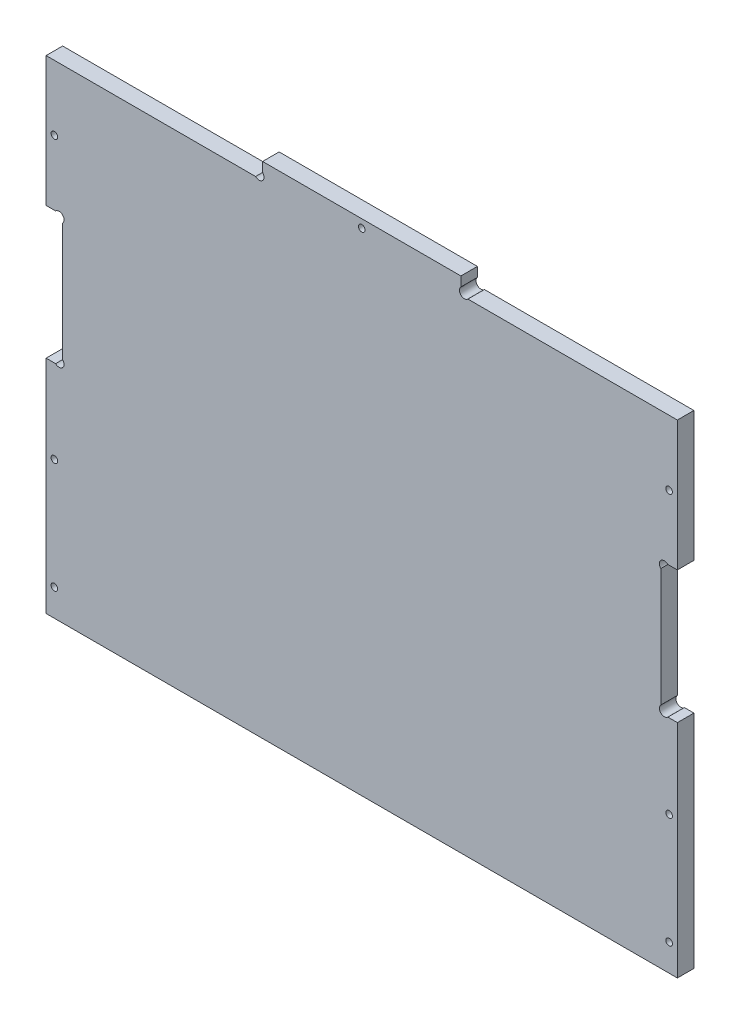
ISO-10303-21;
HEADER;
FILE_DESCRIPTION(('STEP AP214'),'2;1');
FILE_NAME('part.step','',(''),(''),'','','');
FILE_SCHEMA(('AUTOMOTIVE_DESIGN { 1 0 10303 214 1 1 1 1 }'));
ENDSEC;
DATA;
#1=APPLICATION_CONTEXT('core data for automotive mechanical design processes');
#2=APPLICATION_PROTOCOL_DEFINITION('international standard','automotive_design',2000,#1);
#3=PRODUCT_CONTEXT('',#1,'mechanical');
#4=PRODUCT('Part','Part','',(#3));
#5=PRODUCT_RELATED_PRODUCT_CATEGORY('part','',(#4));
#6=PRODUCT_DEFINITION_FORMATION('','',#4);
#7=PRODUCT_DEFINITION_CONTEXT('part definition',#1,'design');
#8=PRODUCT_DEFINITION('design','',#6,#7);
#9=PRODUCT_DEFINITION_SHAPE('','',#8);
#10=(LENGTH_UNIT() NAMED_UNIT(*) SI_UNIT(.MILLI.,.METRE.));
#11=(NAMED_UNIT(*) PLANE_ANGLE_UNIT() SI_UNIT($,.RADIAN.));
#12=(NAMED_UNIT(*) SI_UNIT($,.STERADIAN.) SOLID_ANGLE_UNIT());
#13=UNCERTAINTY_MEASURE_WITH_UNIT(LENGTH_MEASURE(1.E-05),#10,'distance_accuracy_value','');
#14=(GEOMETRIC_REPRESENTATION_CONTEXT(3) GLOBAL_UNCERTAINTY_ASSIGNED_CONTEXT((#13)) GLOBAL_UNIT_ASSIGNED_CONTEXT((#10,
#11,#12)) REPRESENTATION_CONTEXT('',''));
#15=CARTESIAN_POINT('',(0.,0.,0.));
#16=DIRECTION('',(0.,0.,1.));
#17=DIRECTION('',(1.,0.,0.));
#18=AXIS2_PLACEMENT_3D('',#15,#16,#17);
#19=CARTESIAN_POINT('',(30.,0.,5.));
#20=DIRECTION('',(1.,0.,0.));
#21=DIRECTION('',(0.,0.,-1.));
#22=AXIS2_PLACEMENT_3D('',#19,#20,#21);
#23=PLANE('',#22);
#24=DIRECTION('',(0.,-1.,0.));
#25=VECTOR('',#24,1.);
#26=CARTESIAN_POINT('',(30.,0.,0.));
#27=LINE('',#26,#25);
#28=CARTESIAN_POINT('',(30.,40.648672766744,0.));
#29=VERTEX_POINT('',#28);
#30=CARTESIAN_POINT('',(30.,37.7699931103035,0.));
#31=VERTEX_POINT('',#30);
#32=EDGE_CURVE('E232',#29,#31,#27,.T.);
#33=ORIENTED_EDGE('',*,*,#32,.F.);
#34=DIRECTION('',(0.,0.,-1.));
#35=VECTOR('',#34,1.);
#36=CARTESIAN_POINT('',(30.,40.648672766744,5.));
#37=LINE('',#36,#35);
#38=CARTESIAN_POINT('',(30.,40.648672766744,5.));
#39=VERTEX_POINT('',#38);
#40=EDGE_CURVE('E11',#39,#29,#37,.T.);
#41=ORIENTED_EDGE('',*,*,#40,.F.);
#42=DIRECTION('',(0.,-1.,0.));
#43=VECTOR('',#42,1.);
#44=CARTESIAN_POINT('',(30.,0.,5.));
#45=LINE('',#44,#43);
#46=CARTESIAN_POINT('',(30.,37.7699931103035,5.));
#47=VERTEX_POINT('',#46);
#48=EDGE_CURVE('E311',#39,#47,#45,.T.);
#49=ORIENTED_EDGE('',*,*,#48,.T.);
#50=DIRECTION('',(0.,0.,-1.));
#51=VECTOR('',#50,1.);
#52=CARTESIAN_POINT('',(30.,37.7699931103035,5.));
#53=LINE('',#52,#51);
#54=EDGE_CURVE('E126',#47,#31,#53,.T.);
#55=ORIENTED_EDGE('',*,*,#54,.T.);
#56=EDGE_LOOP('',(#33,#41,#49,#55));
#57=FACE_BOUND('',#56,.T.);
#58=ADVANCED_FACE('F34',(#57),#23,.T.);
#59=CARTESIAN_POINT('',(0.,40.648672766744,5.));
#60=DIRECTION('',(0.,1.,0.));
#61=DIRECTION('',(0.,0.,1.));
#62=AXIS2_PLACEMENT_3D('',#59,#60,#61);
#63=PLANE('',#62);
#64=DIRECTION('',(1.,0.,0.));
#65=VECTOR('',#64,1.);
#66=CARTESIAN_POINT('',(0.,40.648672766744,0.));
#67=LINE('',#66,#65);
#68=CARTESIAN_POINT('',(-30.,40.648672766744,0.));
#69=VERTEX_POINT('',#68);
#70=EDGE_CURVE('E235',#69,#29,#67,.T.);
#71=ORIENTED_EDGE('',*,*,#70,.F.);
#72=DIRECTION('',(0.,0.,-1.));
#73=VECTOR('',#72,1.);
#74=CARTESIAN_POINT('',(-30.,40.648672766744,5.));
#75=LINE('',#74,#73);
#76=CARTESIAN_POINT('',(-30.,40.648672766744,5.));
#77=VERTEX_POINT('',#76);
#78=EDGE_CURVE('E42',#77,#69,#75,.T.);
#79=ORIENTED_EDGE('',*,*,#78,.F.);
#80=DIRECTION('',(1.,0.,0.));
#81=VECTOR('',#80,1.);
#82=CARTESIAN_POINT('',(0.,40.648672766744,5.));
#83=LINE('',#82,#81);
#84=EDGE_CURVE('E366',#77,#39,#83,.T.);
#85=ORIENTED_EDGE('',*,*,#84,.T.);
#86=ORIENTED_EDGE('',*,*,#40,.T.);
#87=EDGE_LOOP('',(#71,#79,#85,#86));
#88=FACE_BOUND('',#87,.T.);
#89=ADVANCED_FACE('F365',(#88),#63,.T.);
#90=CARTESIAN_POINT('',(-30.,0.,5.));
#91=DIRECTION('',(1.,0.,0.));
#92=DIRECTION('',(0.,0.,-1.));
#93=AXIS2_PLACEMENT_3D('',#90,#91,#92);
#94=PLANE('',#93);
#95=DIRECTION('',(0.,-1.,0.));
#96=VECTOR('',#95,1.);
#97=CARTESIAN_POINT('',(-30.,0.,0.));
#98=LINE('',#97,#96);
#99=CARTESIAN_POINT('',(-30.,37.7699931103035,0.));
#100=VERTEX_POINT('',#99);
#101=EDGE_CURVE('E238',#69,#100,#98,.T.);
#102=ORIENTED_EDGE('',*,*,#101,.T.);
#103=DIRECTION('',(0.,0.,-1.));
#104=VECTOR('',#103,1.);
#105=CARTESIAN_POINT('',(-30.,37.7699931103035,5.));
#106=LINE('',#105,#104);
#107=CARTESIAN_POINT('',(-30.,37.7699931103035,5.));
#108=VERTEX_POINT('',#107);
#109=EDGE_CURVE('E349',#108,#100,#106,.T.);
#110=ORIENTED_EDGE('',*,*,#109,.F.);
#111=DIRECTION('',(0.,-1.,0.));
#112=VECTOR('',#111,1.);
#113=CARTESIAN_POINT('',(-30.,0.,5.));
#114=LINE('',#113,#112);
#115=EDGE_CURVE('E355',#77,#108,#114,.T.);
#116=ORIENTED_EDGE('',*,*,#115,.F.);
#117=ORIENTED_EDGE('',*,*,#78,.T.);
#118=EDGE_LOOP('',(#102,#110,#116,#117));
#119=FACE_BOUND('',#118,.T.);
#120=ADVANCED_FACE('F353',(#119),#94,.F.);
#121=CARTESIAN_POINT('',(-31.0606601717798,36.7093329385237,5.));
#122=DIRECTION('',(0.,0.,-1.));
#123=DIRECTION('',(-1.,0.,0.));
#124=AXIS2_PLACEMENT_3D('',#121,#122,#123);
#125=CYLINDRICAL_SURFACE('',#124,1.49999999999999);
#126=CARTESIAN_POINT('',(-31.0606601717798,36.7093329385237,0.));
#127=DIRECTION('',(0.,0.,1.));
#128=DIRECTION('',(1.,0.,0.));
#129=AXIS2_PLACEMENT_3D('',#126,#127,#128);
#130=CIRCLE('',#129,1.49999999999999);
#131=CARTESIAN_POINT('',(-32.1213203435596,35.6486727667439,0.));
#132=VERTEX_POINT('',#131);
#133=EDGE_CURVE('E241',#132,#100,#130,.T.);
#134=ORIENTED_EDGE('',*,*,#133,.F.);
#135=DIRECTION('',(0.,0.,-1.));
#136=VECTOR('',#135,1.);
#137=CARTESIAN_POINT('',(-32.1213203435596,35.6486727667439,5.));
#138=LINE('',#137,#136);
#139=CARTESIAN_POINT('',(-32.1213203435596,35.6486727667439,5.));
#140=VERTEX_POINT('',#139);
#141=EDGE_CURVE('E347',#140,#132,#138,.T.);
#142=ORIENTED_EDGE('',*,*,#141,.F.);
#143=CARTESIAN_POINT('',(-31.0606601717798,36.7093329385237,5.));
#144=DIRECTION('',(0.,0.,1.));
#145=DIRECTION('',(1.,0.,0.));
#146=AXIS2_PLACEMENT_3D('',#143,#144,#145);
#147=CIRCLE('',#146,1.49999999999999);
#148=EDGE_CURVE('E372',#140,#108,#147,.T.);
#149=ORIENTED_EDGE('',*,*,#148,.T.);
#150=ORIENTED_EDGE('',*,*,#109,.T.);
#151=EDGE_LOOP('',(#134,#142,#149,#150));
#152=FACE_BOUND('',#151,.T.);
#153=ADVANCED_FACE('F475',(#152),#125,.F.);
#154=CARTESIAN_POINT('',(0.,35.6486727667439,5.));
#155=DIRECTION('',(0.,-1.,0.));
#156=DIRECTION('',(1.,0.,0.));
#157=AXIS2_PLACEMENT_3D('',#154,#155,#156);
#158=PLANE('',#157);
#159=DIRECTION('',(-1.,0.,0.));
#160=VECTOR('',#159,1.);
#161=CARTESIAN_POINT('',(0.,35.6486727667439,0.));
#162=LINE('',#161,#160);
#163=CARTESIAN_POINT('',(-95.5,35.6486727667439,0.));
#164=VERTEX_POINT('',#163);
#165=EDGE_CURVE('E244',#132,#164,#162,.T.);
#166=ORIENTED_EDGE('',*,*,#165,.T.);
#167=DIRECTION('',(0.,0.,-1.));
#168=VECTOR('',#167,1.);
#169=CARTESIAN_POINT('',(-95.5,35.6486727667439,5.));
#170=LINE('',#169,#168);
#171=CARTESIAN_POINT('',(-95.5,35.6486727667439,5.));
#172=VERTEX_POINT('',#171);
#173=EDGE_CURVE('E344',#172,#164,#170,.T.);
#174=ORIENTED_EDGE('',*,*,#173,.F.);
#175=DIRECTION('',(-1.,0.,0.));
#176=VECTOR('',#175,1.);
#177=CARTESIAN_POINT('',(0.,35.6486727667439,5.));
#178=LINE('',#177,#176);
#179=EDGE_CURVE('E375',#140,#172,#178,.T.);
#180=ORIENTED_EDGE('',*,*,#179,.F.);
#181=ORIENTED_EDGE('',*,*,#141,.T.);
#182=EDGE_LOOP('',(#166,#174,#180,#181));
#183=FACE_BOUND('',#182,.T.);
#184=ADVANCED_FACE('F472',(#183),#158,.F.);
#185=CARTESIAN_POINT('',(-95.5,0.,5.));
#186=DIRECTION('',(1.,0.,0.));
#187=DIRECTION('',(0.,0.,-1.));
#188=AXIS2_PLACEMENT_3D('',#185,#186,#187);
#189=PLANE('',#188);
#190=DIRECTION('',(0.,-1.,0.));
#191=VECTOR('',#190,1.);
#192=CARTESIAN_POINT('',(-95.5,0.,0.));
#193=LINE('',#192,#191);
#194=CARTESIAN_POINT('',(-95.5,-3.64132723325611,0.));
#195=VERTEX_POINT('',#194);
#196=EDGE_CURVE('E246',#164,#195,#193,.T.);
#197=ORIENTED_EDGE('',*,*,#196,.T.);
#198=DIRECTION('',(0.,0.,-1.));
#199=VECTOR('',#198,1.);
#200=CARTESIAN_POINT('',(-95.5,-3.64132723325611,5.));
#201=LINE('',#200,#199);
#202=CARTESIAN_POINT('',(-95.5,-3.64132723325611,5.));
#203=VERTEX_POINT('',#202);
#204=EDGE_CURVE('E341',#203,#195,#201,.T.);
#205=ORIENTED_EDGE('',*,*,#204,.F.);
#206=DIRECTION('',(0.,-1.,0.));
#207=VECTOR('',#206,1.);
#208=CARTESIAN_POINT('',(-95.5,0.,5.));
#209=LINE('',#208,#207);
#210=EDGE_CURVE('E377',#172,#203,#209,.T.);
#211=ORIENTED_EDGE('',*,*,#210,.F.);
#212=ORIENTED_EDGE('',*,*,#173,.T.);
#213=EDGE_LOOP('',(#197,#205,#211,#212));
#214=FACE_BOUND('',#213,.T.);
#215=ADVANCED_FACE('F467',(#214),#189,.F.);
#216=CARTESIAN_POINT('',(0.,-3.64132723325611,5.));
#217=DIRECTION('',(0.,1.,0.));
#218=DIRECTION('',(0.,0.,1.));
#219=AXIS2_PLACEMENT_3D('',#216,#217,#218);
#220=PLANE('',#219);
#221=DIRECTION('',(1.,0.,0.));
#222=VECTOR('',#221,1.);
#223=CARTESIAN_POINT('',(0.,-3.64132723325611,0.));
#224=LINE('',#223,#222);
#225=CARTESIAN_POINT('',(-92.6213203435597,-3.64132723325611,0.));
#226=VERTEX_POINT('',#225);
#227=EDGE_CURVE('E248',#195,#226,#224,.T.);
#228=ORIENTED_EDGE('',*,*,#227,.T.);
#229=DIRECTION('',(0.,0.,-1.));
#230=VECTOR('',#229,1.);
#231=CARTESIAN_POINT('',(-92.6213203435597,-3.64132723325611,5.));
#232=LINE('',#231,#230);
#233=CARTESIAN_POINT('',(-92.6213203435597,-3.64132723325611,5.));
#234=VERTEX_POINT('',#233);
#235=EDGE_CURVE('E339',#234,#226,#232,.T.);
#236=ORIENTED_EDGE('',*,*,#235,.F.);
#237=DIRECTION('',(1.,0.,0.));
#238=VECTOR('',#237,1.);
#239=CARTESIAN_POINT('',(0.,-3.64132723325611,5.));
#240=LINE('',#239,#238);
#241=EDGE_CURVE('E379',#203,#234,#240,.T.);
#242=ORIENTED_EDGE('',*,*,#241,.F.);
#243=ORIENTED_EDGE('',*,*,#204,.T.);
#244=EDGE_LOOP('',(#228,#236,#242,#243));
#245=FACE_BOUND('',#244,.T.);
#246=ADVANCED_FACE('F463',(#245),#220,.F.);
#247=CARTESIAN_POINT('',(-91.5606601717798,-4.70198740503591,5.));
#248=DIRECTION('',(0.,0.,-1.));
#249=DIRECTION('',(-1.,0.,0.));
#250=AXIS2_PLACEMENT_3D('',#247,#248,#249);
#251=CYLINDRICAL_SURFACE('',#250,1.50000000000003);
#252=CARTESIAN_POINT('',(-91.5606601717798,-4.70198740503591,0.));
#253=DIRECTION('',(0.,0.,1.));
#254=DIRECTION('',(1.,0.,0.));
#255=AXIS2_PLACEMENT_3D('',#252,#253,#254);
#256=CIRCLE('',#255,1.50000000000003);
#257=CARTESIAN_POINT('',(-90.5000000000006,-5.76264757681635,0.));
#258=VERTEX_POINT('',#257);
#259=EDGE_CURVE('E251',#258,#226,#256,.T.);
#260=ORIENTED_EDGE('',*,*,#259,.F.);
#261=DIRECTION('',(0.,0.,-1.));
#262=VECTOR('',#261,1.);
#263=CARTESIAN_POINT('',(-90.5000000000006,-5.76264757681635,5.));
#264=LINE('',#263,#262);
#265=CARTESIAN_POINT('',(-90.5000000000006,-5.76264757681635,5.));
#266=VERTEX_POINT('',#265);
#267=EDGE_CURVE('E337',#266,#258,#264,.T.);
#268=ORIENTED_EDGE('',*,*,#267,.F.);
#269=CARTESIAN_POINT('',(-91.5606601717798,-4.70198740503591,5.));
#270=DIRECTION('',(0.,0.,1.));
#271=DIRECTION('',(1.,0.,0.));
#272=AXIS2_PLACEMENT_3D('',#269,#270,#271);
#273=CIRCLE('',#272,1.50000000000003);
#274=EDGE_CURVE('E381',#266,#234,#273,.T.);
#275=ORIENTED_EDGE('',*,*,#274,.T.);
#276=ORIENTED_EDGE('',*,*,#235,.T.);
#277=EDGE_LOOP('',(#260,#268,#275,#276));
#278=FACE_BOUND('',#277,.T.);
#279=ADVANCED_FACE('F458',(#278),#251,.F.);
#280=CARTESIAN_POINT('',(-90.5000000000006,0.,5.));
#281=DIRECTION('',(1.,0.,0.));
#282=DIRECTION('',(0.,1.,0.));
#283=AXIS2_PLACEMENT_3D('',#280,#281,#282);
#284=PLANE('',#283);
#285=DIRECTION('',(0.,-1.,0.));
#286=VECTOR('',#285,1.);
#287=CARTESIAN_POINT('',(-90.5000000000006,0.,0.));
#288=LINE('',#287,#286);
#289=CARTESIAN_POINT('',(-90.5000000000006,-41.5200068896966,0.));
#290=VERTEX_POINT('',#289);
#291=EDGE_CURVE('E254',#258,#290,#288,.T.);
#292=ORIENTED_EDGE('',*,*,#291,.T.);
#293=DIRECTION('',(0.,0.,-1.));
#294=VECTOR('',#293,1.);
#295=CARTESIAN_POINT('',(-90.5000000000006,-41.5200068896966,5.));
#296=LINE('',#295,#294);
#297=CARTESIAN_POINT('',(-90.5000000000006,-41.5200068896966,5.));
#298=VERTEX_POINT('',#297);
#299=EDGE_CURVE('E335',#298,#290,#296,.T.);
#300=ORIENTED_EDGE('',*,*,#299,.F.);
#301=DIRECTION('',(0.,-1.,0.));
#302=VECTOR('',#301,1.);
#303=CARTESIAN_POINT('',(-90.5000000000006,0.,5.));
#304=LINE('',#303,#302);
#305=EDGE_CURVE('E384',#266,#298,#304,.T.);
#306=ORIENTED_EDGE('',*,*,#305,.F.);
#307=ORIENTED_EDGE('',*,*,#267,.T.);
#308=EDGE_LOOP('',(#292,#300,#306,#307));
#309=FACE_BOUND('',#308,.T.);
#310=ADVANCED_FACE('F454',(#309),#284,.F.);
#311=CARTESIAN_POINT('',(-91.5606601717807,-42.5806670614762,5.));
#312=DIRECTION('',(0.,0.,-1.));
#313=DIRECTION('',(-1.,0.,0.));
#314=AXIS2_PLACEMENT_3D('',#311,#312,#313);
#315=CYLINDRICAL_SURFACE('',#314,1.50000000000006);
#316=CARTESIAN_POINT('',(-91.5606601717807,-42.5806670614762,0.));
#317=DIRECTION('',(0.,0.,1.));
#318=DIRECTION('',(1.,0.,0.));
#319=AXIS2_PLACEMENT_3D('',#316,#317,#318);
#320=CIRCLE('',#319,1.50000000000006);
#321=CARTESIAN_POINT('',(-92.6213203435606,-43.6413272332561,0.));
#322=VERTEX_POINT('',#321);
#323=EDGE_CURVE('E257',#322,#290,#320,.T.);
#324=ORIENTED_EDGE('',*,*,#323,.F.);
#325=DIRECTION('',(0.,0.,-1.));
#326=VECTOR('',#325,1.);
#327=CARTESIAN_POINT('',(-92.6213203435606,-43.6413272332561,5.));
#328=LINE('',#327,#326);
#329=CARTESIAN_POINT('',(-92.6213203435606,-43.6413272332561,5.));
#330=VERTEX_POINT('',#329);
#331=EDGE_CURVE('E333',#330,#322,#328,.T.);
#332=ORIENTED_EDGE('',*,*,#331,.F.);
#333=CARTESIAN_POINT('',(-91.5606601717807,-42.5806670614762,5.));
#334=DIRECTION('',(0.,0.,1.));
#335=DIRECTION('',(1.,0.,0.));
#336=AXIS2_PLACEMENT_3D('',#333,#334,#335);
#337=CIRCLE('',#336,1.50000000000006);
#338=EDGE_CURVE('E386',#330,#298,#337,.T.);
#339=ORIENTED_EDGE('',*,*,#338,.T.);
#340=ORIENTED_EDGE('',*,*,#299,.T.);
#341=EDGE_LOOP('',(#324,#332,#339,#340));
#342=FACE_BOUND('',#341,.T.);
#343=ADVANCED_FACE('F450',(#342),#315,.F.);
#344=CARTESIAN_POINT('',(-3.15584826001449E-13,-43.6413272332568,5.));
#345=DIRECTION('',(0.,-1.,0.));
#346=DIRECTION('',(1.,0.,0.));
#347=AXIS2_PLACEMENT_3D('',#344,#345,#346);
#348=PLANE('',#347);
#349=DIRECTION('',(-1.,0.,0.));
#350=VECTOR('',#349,1.);
#351=CARTESIAN_POINT('',(-3.15584826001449E-13,-43.6413272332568,0.));
#352=LINE('',#351,#350);
#353=CARTESIAN_POINT('',(-95.5000000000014,-43.6413272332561,0.));
#354=VERTEX_POINT('',#353);
#355=EDGE_CURVE('E260',#322,#354,#352,.T.);
#356=ORIENTED_EDGE('',*,*,#355,.T.);
#357=DIRECTION('',(0.,0.,-1.));
#358=VECTOR('',#357,1.);
#359=CARTESIAN_POINT('',(-95.5000000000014,-43.6413272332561,5.));
#360=LINE('',#359,#358);
#361=CARTESIAN_POINT('',(-95.5000000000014,-43.6413272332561,5.));
#362=VERTEX_POINT('',#361);
#363=EDGE_CURVE('E330',#362,#354,#360,.T.);
#364=ORIENTED_EDGE('',*,*,#363,.F.);
#365=DIRECTION('',(-1.,0.,0.));
#366=VECTOR('',#365,1.);
#367=CARTESIAN_POINT('',(-3.15584826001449E-13,-43.6413272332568,5.));
#368=LINE('',#367,#366);
#369=EDGE_CURVE('E389',#330,#362,#368,.T.);
#370=ORIENTED_EDGE('',*,*,#369,.F.);
#371=ORIENTED_EDGE('',*,*,#331,.T.);
#372=EDGE_LOOP('',(#356,#364,#370,#371));
#373=FACE_BOUND('',#372,.T.);
#374=ADVANCED_FACE('F445',(#373),#348,.F.);
#375=CARTESIAN_POINT('',(-95.5000000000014,0.,5.));
#376=DIRECTION('',(1.,0.,0.));
#377=DIRECTION('',(0.,1.,0.));
#378=AXIS2_PLACEMENT_3D('',#375,#376,#377);
#379=PLANE('',#378);
#380=DIRECTION('',(0.,-1.,0.));
#381=VECTOR('',#380,1.);
#382=CARTESIAN_POINT('',(-95.5000000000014,0.,0.));
#383=LINE('',#382,#381);
#384=CARTESIAN_POINT('',(-95.5000000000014,-110.561327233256,0.));
#385=VERTEX_POINT('',#384);
#386=EDGE_CURVE('E262',#354,#385,#383,.T.);
#387=ORIENTED_EDGE('',*,*,#386,.T.);
#388=DIRECTION('',(0.,0.,-1.));
#389=VECTOR('',#388,1.);
#390=CARTESIAN_POINT('',(-95.5000000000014,-110.561327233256,5.));
#391=LINE('',#390,#389);
#392=CARTESIAN_POINT('',(-95.5000000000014,-110.561327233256,5.));
#393=VERTEX_POINT('',#392);
#394=EDGE_CURVE('E327',#393,#385,#391,.T.);
#395=ORIENTED_EDGE('',*,*,#394,.F.);
#396=DIRECTION('',(0.,-1.,0.));
#397=VECTOR('',#396,1.);
#398=CARTESIAN_POINT('',(-95.5000000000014,0.,5.));
#399=LINE('',#398,#397);
#400=EDGE_CURVE('E391',#362,#393,#399,.T.);
#401=ORIENTED_EDGE('',*,*,#400,.F.);
#402=ORIENTED_EDGE('',*,*,#363,.T.);
#403=EDGE_LOOP('',(#387,#395,#401,#402));
#404=FACE_BOUND('',#403,.T.);
#405=ADVANCED_FACE('F441',(#404),#379,.F.);
#406=CARTESIAN_POINT('',(0.,-110.561327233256,5.));
#407=DIRECTION('',(0.,1.,0.));
#408=DIRECTION('',(0.,0.,1.));
#409=AXIS2_PLACEMENT_3D('',#406,#407,#408);
#410=PLANE('',#409);
#411=DIRECTION('',(1.,0.,0.));
#412=VECTOR('',#411,1.);
#413=CARTESIAN_POINT('',(0.,-110.561327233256,0.));
#414=LINE('',#413,#412);
#415=CARTESIAN_POINT('',(95.5000000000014,-110.561327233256,0.));
#416=VERTEX_POINT('',#415);
#417=EDGE_CURVE('E264',#385,#416,#414,.T.);
#418=ORIENTED_EDGE('',*,*,#417,.T.);
#419=DIRECTION('',(0.,0.,-1.));
#420=VECTOR('',#419,1.);
#421=CARTESIAN_POINT('',(95.5000000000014,-110.561327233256,5.));
#422=LINE('',#421,#420);
#423=CARTESIAN_POINT('',(95.5000000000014,-110.561327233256,5.));
#424=VERTEX_POINT('',#423);
#425=EDGE_CURVE('E325',#424,#416,#422,.T.);
#426=ORIENTED_EDGE('',*,*,#425,.F.);
#427=DIRECTION('',(1.,0.,0.));
#428=VECTOR('',#427,1.);
#429=CARTESIAN_POINT('',(0.,-110.561327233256,5.));
#430=LINE('',#429,#428);
#431=EDGE_CURVE('E393',#393,#424,#430,.T.);
#432=ORIENTED_EDGE('',*,*,#431,.F.);
#433=ORIENTED_EDGE('',*,*,#394,.T.);
#434=EDGE_LOOP('',(#418,#426,#432,#433));
#435=FACE_BOUND('',#434,.T.);
#436=ADVANCED_FACE('F436',(#435),#410,.F.);
#437=CARTESIAN_POINT('',(95.5000000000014,0.,5.));
#438=DIRECTION('',(1.,0.,0.));
#439=DIRECTION('',(0.,1.,0.));
#440=AXIS2_PLACEMENT_3D('',#437,#438,#439);
#441=PLANE('',#440);
#442=DIRECTION('',(0.,-1.,0.));
#443=VECTOR('',#442,1.);
#444=CARTESIAN_POINT('',(95.5000000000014,0.,0.));
#445=LINE('',#444,#443);
#446=CARTESIAN_POINT('',(95.5000000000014,-43.6413272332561,0.));
#447=VERTEX_POINT('',#446);
#448=EDGE_CURVE('E267',#447,#416,#445,.T.);
#449=ORIENTED_EDGE('',*,*,#448,.F.);
#450=DIRECTION('',(0.,0.,-1.));
#451=VECTOR('',#450,1.);
#452=CARTESIAN_POINT('',(95.5000000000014,-43.6413272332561,5.));
#453=LINE('',#452,#451);
#454=CARTESIAN_POINT('',(95.5000000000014,-43.6413272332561,5.));
#455=VERTEX_POINT('',#454);
#456=EDGE_CURVE('E323',#455,#447,#453,.T.);
#457=ORIENTED_EDGE('',*,*,#456,.F.);
#458=DIRECTION('',(0.,-1.,0.));
#459=VECTOR('',#458,1.);
#460=CARTESIAN_POINT('',(95.5000000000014,0.,5.));
#461=LINE('',#460,#459);
#462=EDGE_CURVE('E395',#455,#424,#461,.T.);
#463=ORIENTED_EDGE('',*,*,#462,.T.);
#464=ORIENTED_EDGE('',*,*,#425,.T.);
#465=EDGE_LOOP('',(#449,#457,#463,#464));
#466=FACE_BOUND('',#465,.T.);
#467=ADVANCED_FACE('F430',(#466),#441,.T.);
#468=CARTESIAN_POINT('',(0.,-43.6413272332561,5.));
#469=DIRECTION('',(0.,1.,0.));
#470=DIRECTION('',(0.,0.,1.));
#471=AXIS2_PLACEMENT_3D('',#468,#469,#470);
#472=PLANE('',#471);
#473=DIRECTION('',(1.,0.,0.));
#474=VECTOR('',#473,1.);
#475=CARTESIAN_POINT('',(0.,-43.6413272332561,0.));
#476=LINE('',#475,#474);
#477=CARTESIAN_POINT('',(92.6213203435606,-43.6413272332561,0.));
#478=VERTEX_POINT('',#477);
#479=EDGE_CURVE('E270',#478,#447,#476,.T.);
#480=ORIENTED_EDGE('',*,*,#479,.F.);
#481=DIRECTION('',(0.,0.,-1.));
#482=VECTOR('',#481,1.);
#483=CARTESIAN_POINT('',(92.6213203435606,-43.6413272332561,5.));
#484=LINE('',#483,#482);
#485=CARTESIAN_POINT('',(92.6213203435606,-43.6413272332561,5.));
#486=VERTEX_POINT('',#485);
#487=EDGE_CURVE('E321',#486,#478,#484,.T.);
#488=ORIENTED_EDGE('',*,*,#487,.F.);
#489=DIRECTION('',(1.,0.,0.));
#490=VECTOR('',#489,1.);
#491=CARTESIAN_POINT('',(0.,-43.6413272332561,5.));
#492=LINE('',#491,#490);
#493=EDGE_CURVE('E398',#486,#455,#492,.T.);
#494=ORIENTED_EDGE('',*,*,#493,.T.);
#495=ORIENTED_EDGE('',*,*,#456,.T.);
#496=EDGE_LOOP('',(#480,#488,#494,#495));
#497=FACE_BOUND('',#496,.T.);
#498=ADVANCED_FACE('F425',(#497),#472,.T.);
#499=CARTESIAN_POINT('',(91.5606601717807,-42.5806670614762,5.));
#500=DIRECTION('',(0.,0.,-1.));
#501=DIRECTION('',(-1.,0.,0.));
#502=AXIS2_PLACEMENT_3D('',#499,#500,#501);
#503=CYLINDRICAL_SURFACE('',#502,1.50000000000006);
#504=CARTESIAN_POINT('',(91.5606601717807,-42.5806670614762,0.));
#505=DIRECTION('',(0.,0.,1.));
#506=DIRECTION('',(1.,0.,0.));
#507=AXIS2_PLACEMENT_3D('',#504,#505,#506);
#508=CIRCLE('',#507,1.50000000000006);
#509=CARTESIAN_POINT('',(90.5000000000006,-41.5200068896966,0.));
#510=VERTEX_POINT('',#509);
#511=EDGE_CURVE('E273',#478,#510,#508,.F.);
#512=ORIENTED_EDGE('',*,*,#511,.T.);
#513=DIRECTION('',(0.,0.,-1.));
#514=VECTOR('',#513,1.);
#515=CARTESIAN_POINT('',(90.5000000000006,-41.5200068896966,5.));
#516=LINE('',#515,#514);
#517=CARTESIAN_POINT('',(90.5000000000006,-41.5200068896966,5.));
#518=VERTEX_POINT('',#517);
#519=EDGE_CURVE('E319',#518,#510,#516,.T.);
#520=ORIENTED_EDGE('',*,*,#519,.F.);
#521=CARTESIAN_POINT('',(91.5606601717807,-42.5806670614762,5.));
#522=DIRECTION('',(0.,0.,1.));
#523=DIRECTION('',(1.,0.,0.));
#524=AXIS2_PLACEMENT_3D('',#521,#522,#523);
#525=CIRCLE('',#524,1.50000000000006);
#526=EDGE_CURVE('E401',#486,#518,#525,.F.);
#527=ORIENTED_EDGE('',*,*,#526,.F.);
#528=ORIENTED_EDGE('',*,*,#487,.T.);
#529=EDGE_LOOP('',(#512,#520,#527,#528));
#530=FACE_BOUND('',#529,.T.);
#531=ADVANCED_FACE('F422',(#530),#503,.F.);
#532=CARTESIAN_POINT('',(90.5000000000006,0.,5.));
#533=DIRECTION('',(1.,0.,0.));
#534=DIRECTION('',(0.,0.,-1.));
#535=AXIS2_PLACEMENT_3D('',#532,#533,#534);
#536=PLANE('',#535);
#537=DIRECTION('',(0.,-1.,0.));
#538=VECTOR('',#537,1.);
#539=CARTESIAN_POINT('',(90.5000000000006,0.,0.));
#540=LINE('',#539,#538);
#541=CARTESIAN_POINT('',(90.5000000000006,-5.76264757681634,0.));
#542=VERTEX_POINT('',#541);
#543=EDGE_CURVE('E276',#542,#510,#540,.T.);
#544=ORIENTED_EDGE('',*,*,#543,.F.);
#545=DIRECTION('',(0.,0.,-1.));
#546=VECTOR('',#545,1.);
#547=CARTESIAN_POINT('',(90.5000000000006,-5.76264757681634,5.));
#548=LINE('',#547,#546);
#549=CARTESIAN_POINT('',(90.5000000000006,-5.76264757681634,5.));
#550=VERTEX_POINT('',#549);
#551=EDGE_CURVE('E317',#550,#542,#548,.T.);
#552=ORIENTED_EDGE('',*,*,#551,.F.);
#553=DIRECTION('',(0.,-1.,0.));
#554=VECTOR('',#553,1.);
#555=CARTESIAN_POINT('',(90.5000000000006,0.,5.));
#556=LINE('',#555,#554);
#557=EDGE_CURVE('E403',#550,#518,#556,.T.);
#558=ORIENTED_EDGE('',*,*,#557,.T.);
#559=ORIENTED_EDGE('',*,*,#519,.T.);
#560=EDGE_LOOP('',(#544,#552,#558,#559));
#561=FACE_BOUND('',#560,.T.);
#562=ADVANCED_FACE('F416',(#561),#536,.T.);
#563=CARTESIAN_POINT('',(91.5606601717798,-4.70198740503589,5.));
#564=DIRECTION('',(0.,0.,-1.));
#565=DIRECTION('',(-1.,0.,0.));
#566=AXIS2_PLACEMENT_3D('',#563,#564,#565);
#567=CYLINDRICAL_SURFACE('',#566,1.50000000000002);
#568=CARTESIAN_POINT('',(91.5606601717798,-4.70198740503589,0.));
#569=DIRECTION('',(0.,0.,1.));
#570=DIRECTION('',(1.,0.,0.));
#571=AXIS2_PLACEMENT_3D('',#568,#569,#570);
#572=CIRCLE('',#571,1.50000000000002);
#573=CARTESIAN_POINT('',(92.6213203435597,-3.64132723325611,0.));
#574=VERTEX_POINT('',#573);
#575=EDGE_CURVE('E279',#542,#574,#572,.F.);
#576=ORIENTED_EDGE('',*,*,#575,.T.);
#577=DIRECTION('',(0.,0.,-1.));
#578=VECTOR('',#577,1.);
#579=CARTESIAN_POINT('',(92.6213203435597,-3.64132723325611,5.));
#580=LINE('',#579,#578);
#581=CARTESIAN_POINT('',(92.6213203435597,-3.64132723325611,5.));
#582=VERTEX_POINT('',#581);
#583=EDGE_CURVE('E315',#582,#574,#580,.T.);
#584=ORIENTED_EDGE('',*,*,#583,.F.);
#585=CARTESIAN_POINT('',(91.5606601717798,-4.70198740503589,5.));
#586=DIRECTION('',(0.,0.,1.));
#587=DIRECTION('',(1.,0.,0.));
#588=AXIS2_PLACEMENT_3D('',#585,#586,#587);
#589=CIRCLE('',#588,1.50000000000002);
#590=EDGE_CURVE('E406',#550,#582,#589,.F.);
#591=ORIENTED_EDGE('',*,*,#590,.F.);
#592=ORIENTED_EDGE('',*,*,#551,.T.);
#593=EDGE_LOOP('',(#576,#584,#591,#592));
#594=FACE_BOUND('',#593,.T.);
#595=ADVANCED_FACE('F476',(#594),#567,.F.);
#596=CARTESIAN_POINT('',(0.,-3.64132723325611,5.));
#597=DIRECTION('',(0.,-1.,0.));
#598=DIRECTION('',(0.,0.,-1.));
#599=AXIS2_PLACEMENT_3D('',#596,#597,#598);
#600=PLANE('',#599);
#601=DIRECTION('',(-1.,0.,0.));
#602=VECTOR('',#601,1.);
#603=CARTESIAN_POINT('',(0.,-3.64132723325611,0.));
#604=LINE('',#603,#602);
#605=CARTESIAN_POINT('',(95.5,-3.64132723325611,0.));
#606=VERTEX_POINT('',#605);
#607=EDGE_CURVE('E282',#606,#574,#604,.T.);
#608=ORIENTED_EDGE('',*,*,#607,.F.);
#609=DIRECTION('',(0.,0.,-1.));
#610=VECTOR('',#609,1.);
#611=CARTESIAN_POINT('',(95.5,-3.64132723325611,5.));
#612=LINE('',#611,#610);
#613=CARTESIAN_POINT('',(95.5,-3.64132723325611,5.));
#614=VERTEX_POINT('',#613);
#615=EDGE_CURVE('E197',#614,#606,#612,.T.);
#616=ORIENTED_EDGE('',*,*,#615,.F.);
#617=DIRECTION('',(-1.,0.,0.));
#618=VECTOR('',#617,1.);
#619=CARTESIAN_POINT('',(0.,-3.64132723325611,5.));
#620=LINE('',#619,#618);
#621=EDGE_CURVE('E204',#614,#582,#620,.T.);
#622=ORIENTED_EDGE('',*,*,#621,.T.);
#623=ORIENTED_EDGE('',*,*,#583,.T.);
#624=EDGE_LOOP('',(#608,#616,#622,#623));
#625=FACE_BOUND('',#624,.T.);
#626=ADVANCED_FACE('F409',(#625),#600,.T.);
#627=CARTESIAN_POINT('',(95.5,0.,5.));
#628=DIRECTION('',(1.,0.,0.));
#629=DIRECTION('',(0.,0.,-1.));
#630=AXIS2_PLACEMENT_3D('',#627,#628,#629);
#631=PLANE('',#630);
#632=DIRECTION('',(0.,-1.,0.));
#633=VECTOR('',#632,1.);
#634=CARTESIAN_POINT('',(95.5,0.,0.));
#635=LINE('',#634,#633);
#636=CARTESIAN_POINT('',(95.5,35.6486727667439,0.));
#637=VERTEX_POINT('',#636);
#638=EDGE_CURVE('E192',#637,#606,#635,.T.);
#639=ORIENTED_EDGE('',*,*,#638,.F.);
#640=DIRECTION('',(0.,0.,-1.));
#641=VECTOR('',#640,1.);
#642=CARTESIAN_POINT('',(95.5,35.6486727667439,5.));
#643=LINE('',#642,#641);
#644=CARTESIAN_POINT('',(95.5,35.6486727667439,5.));
#645=VERTEX_POINT('',#644);
#646=EDGE_CURVE('E187',#645,#637,#643,.T.);
#647=ORIENTED_EDGE('',*,*,#646,.F.);
#648=DIRECTION('',(0.,-1.,0.));
#649=VECTOR('',#648,1.);
#650=CARTESIAN_POINT('',(95.5,0.,5.));
#651=LINE('',#650,#649);
#652=EDGE_CURVE('E190',#645,#614,#651,.T.);
#653=ORIENTED_EDGE('',*,*,#652,.T.);
#654=ORIENTED_EDGE('',*,*,#615,.T.);
#655=EDGE_LOOP('',(#639,#647,#653,#654));
#656=FACE_BOUND('',#655,.T.);
#657=ADVANCED_FACE('F189',(#656),#631,.T.);
#658=CARTESIAN_POINT('',(0.,35.6486727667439,5.));
#659=DIRECTION('',(0.,1.,0.));
#660=DIRECTION('',(-1.,0.,0.));
#661=AXIS2_PLACEMENT_3D('',#658,#659,#660);
#662=PLANE('',#661);
#663=DIRECTION('',(1.,0.,0.));
#664=VECTOR('',#663,1.);
#665=CARTESIAN_POINT('',(0.,35.6486727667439,0.));
#666=LINE('',#665,#664);
#667=CARTESIAN_POINT('',(32.1213203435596,35.6486727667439,0.));
#668=VERTEX_POINT('',#667);
#669=EDGE_CURVE('E286',#668,#637,#666,.T.);
#670=ORIENTED_EDGE('',*,*,#669,.F.);
#671=DIRECTION('',(0.,0.,-1.));
#672=VECTOR('',#671,1.);
#673=CARTESIAN_POINT('',(32.1213203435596,35.6486727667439,5.));
#674=LINE('',#673,#672);
#675=CARTESIAN_POINT('',(32.1213203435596,35.6486727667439,5.));
#676=VERTEX_POINT('',#675);
#677=EDGE_CURVE('E119',#676,#668,#674,.T.);
#678=ORIENTED_EDGE('',*,*,#677,.F.);
#679=DIRECTION('',(1.,0.,0.));
#680=VECTOR('',#679,1.);
#681=CARTESIAN_POINT('',(0.,35.6486727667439,5.));
#682=LINE('',#681,#680);
#683=EDGE_CURVE('E202',#676,#645,#682,.T.);
#684=ORIENTED_EDGE('',*,*,#683,.T.);
#685=ORIENTED_EDGE('',*,*,#646,.T.);
#686=EDGE_LOOP('',(#670,#678,#684,#685));
#687=FACE_BOUND('',#686,.T.);
#688=ADVANCED_FACE('F206',(#687),#662,.T.);
#689=CARTESIAN_POINT('',(93.,16.0036727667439,5.));
#690=DIRECTION('',(0.,0.,-1.));
#691=DIRECTION('',(-1.,0.,0.));
#692=AXIS2_PLACEMENT_3D('',#689,#690,#691);
#693=CYLINDRICAL_SURFACE('',#692,0.999999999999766);
#694=CARTESIAN_POINT('',(93.,16.0036727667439,5.));
#695=DIRECTION('',(0.,0.,1.));
#696=DIRECTION('',(1.,0.,0.));
#697=AXIS2_PLACEMENT_3D('',#694,#695,#696);
#698=CIRCLE('',#697,0.999999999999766);
#699=CARTESIAN_POINT('',(93.9999999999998,16.0036727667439,5.));
#700=VERTEX_POINT('',#699);
#701=EDGE_CURVE('E226',#700,#700,#698,.F.);
#702=ORIENTED_EDGE('',*,*,#701,.F.);
#703=EDGE_LOOP('',(#702));
#704=FACE_BOUND('',#703,.T.);
#705=CARTESIAN_POINT('',(93.,16.0036727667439,0.));
#706=DIRECTION('',(0.,0.,1.));
#707=DIRECTION('',(1.,0.,0.));
#708=AXIS2_PLACEMENT_3D('',#705,#706,#707);
#709=CIRCLE('',#708,0.999999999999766);
#710=CARTESIAN_POINT('',(93.9999999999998,16.0036727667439,0.));
#711=VERTEX_POINT('',#710);
#712=EDGE_CURVE('E305',#711,#711,#709,.F.);
#713=ORIENTED_EDGE('',*,*,#712,.T.);
#714=EDGE_LOOP('',(#713));
#715=FACE_BOUND('',#714,.T.);
#716=ADVANCED_FACE('F554',(#704,#715),#693,.F.);
#717=CARTESIAN_POINT('',(93.0000000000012,-68.921327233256,5.));
#718=DIRECTION('',(0.,0.,-1.));
#719=DIRECTION('',(-1.,0.,0.));
#720=AXIS2_PLACEMENT_3D('',#717,#718,#719);
#721=CYLINDRICAL_SURFACE('',#720,0.999999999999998);
#722=CARTESIAN_POINT('',(93.0000000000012,-68.921327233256,5.));
#723=DIRECTION('',(0.,0.,1.));
#724=DIRECTION('',(1.,0.,0.));
#725=AXIS2_PLACEMENT_3D('',#722,#723,#724);
#726=CIRCLE('',#725,0.999999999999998);
#727=CARTESIAN_POINT('',(94.0000000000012,-68.921327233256,5.));
#728=VERTEX_POINT('',#727);
#729=EDGE_CURVE('E223',#728,#728,#726,.F.);
#730=ORIENTED_EDGE('',*,*,#729,.F.);
#731=EDGE_LOOP('',(#730));
#732=FACE_BOUND('',#731,.T.);
#733=CARTESIAN_POINT('',(93.0000000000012,-68.921327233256,0.));
#734=DIRECTION('',(0.,0.,1.));
#735=DIRECTION('',(1.,0.,0.));
#736=AXIS2_PLACEMENT_3D('',#733,#734,#735);
#737=CIRCLE('',#736,0.999999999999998);
#738=CARTESIAN_POINT('',(94.0000000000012,-68.921327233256,0.));
#739=VERTEX_POINT('',#738);
#740=EDGE_CURVE('E302',#739,#739,#737,.F.);
#741=ORIENTED_EDGE('',*,*,#740,.T.);
#742=EDGE_LOOP('',(#741));
#743=FACE_BOUND('',#742,.T.);
#744=ADVANCED_FACE('F563',(#732,#743),#721,.F.);
#745=CARTESIAN_POINT('',(-93.0000000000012,-68.921327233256,5.));
#746=DIRECTION('',(0.,0.,-1.));
#747=DIRECTION('',(-1.,0.,0.));
#748=AXIS2_PLACEMENT_3D('',#745,#746,#747);
#749=CYLINDRICAL_SURFACE('',#748,0.999999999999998);
#750=CARTESIAN_POINT('',(-93.0000000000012,-68.921327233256,5.));
#751=DIRECTION('',(0.,0.,1.));
#752=DIRECTION('',(1.,0.,0.));
#753=AXIS2_PLACEMENT_3D('',#750,#751,#752);
#754=CIRCLE('',#753,0.999999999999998);
#755=CARTESIAN_POINT('',(-92.0000000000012,-68.921327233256,5.));
#756=VERTEX_POINT('',#755);
#757=EDGE_CURVE('E220',#756,#756,#754,.T.);
#758=ORIENTED_EDGE('',*,*,#757,.T.);
#759=EDGE_LOOP('',(#758));
#760=FACE_BOUND('',#759,.T.);
#761=CARTESIAN_POINT('',(-93.0000000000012,-68.921327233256,0.));
#762=DIRECTION('',(0.,0.,1.));
#763=DIRECTION('',(1.,0.,0.));
#764=AXIS2_PLACEMENT_3D('',#761,#762,#763);
#765=CIRCLE('',#764,0.999999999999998);
#766=CARTESIAN_POINT('',(-92.0000000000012,-68.921327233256,0.));
#767=VERTEX_POINT('',#766);
#768=EDGE_CURVE('E299',#767,#767,#765,.T.);
#769=ORIENTED_EDGE('',*,*,#768,.F.);
#770=EDGE_LOOP('',(#769));
#771=FACE_BOUND('',#770,.T.);
#772=ADVANCED_FACE('F573',(#760,#771),#749,.F.);
#773=CARTESIAN_POINT('',(-93.0000000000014,-102.381327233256,5.));
#774=DIRECTION('',(0.,0.,-1.));
#775=DIRECTION('',(-1.,0.,0.));
#776=AXIS2_PLACEMENT_3D('',#773,#774,#775);
#777=CYLINDRICAL_SURFACE('',#776,1.00000000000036);
#778=CARTESIAN_POINT('',(-93.0000000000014,-102.381327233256,5.));
#779=DIRECTION('',(0.,0.,1.));
#780=DIRECTION('',(1.,0.,0.));
#781=AXIS2_PLACEMENT_3D('',#778,#779,#780);
#782=CIRCLE('',#781,1.00000000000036);
#783=CARTESIAN_POINT('',(-92.000000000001,-102.381327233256,5.));
#784=VERTEX_POINT('',#783);
#785=EDGE_CURVE('E217',#784,#784,#782,.T.);
#786=ORIENTED_EDGE('',*,*,#785,.T.);
#787=EDGE_LOOP('',(#786));
#788=FACE_BOUND('',#787,.T.);
#789=CARTESIAN_POINT('',(-93.0000000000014,-102.381327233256,0.));
#790=DIRECTION('',(0.,0.,1.));
#791=DIRECTION('',(1.,0.,0.));
#792=AXIS2_PLACEMENT_3D('',#789,#790,#791);
#793=CIRCLE('',#792,1.00000000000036);
#794=CARTESIAN_POINT('',(-92.000000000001,-102.381327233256,0.));
#795=VERTEX_POINT('',#794);
#796=EDGE_CURVE('E296',#795,#795,#793,.T.);
#797=ORIENTED_EDGE('',*,*,#796,.F.);
#798=EDGE_LOOP('',(#797));
#799=FACE_BOUND('',#798,.T.);
#800=ADVANCED_FACE('F583',(#788,#799),#777,.F.);
#801=CARTESIAN_POINT('',(-93.,16.0036727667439,5.));
#802=DIRECTION('',(0.,0.,-1.));
#803=DIRECTION('',(-1.,0.,0.));
#804=AXIS2_PLACEMENT_3D('',#801,#802,#803);
#805=CYLINDRICAL_SURFACE('',#804,0.999999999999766);
#806=CARTESIAN_POINT('',(-93.,16.0036727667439,5.));
#807=DIRECTION('',(0.,0.,1.));
#808=DIRECTION('',(1.,0.,0.));
#809=AXIS2_PLACEMENT_3D('',#806,#807,#808);
#810=CIRCLE('',#809,0.999999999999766);
#811=CARTESIAN_POINT('',(-92.0000000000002,16.0036727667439,5.));
#812=VERTEX_POINT('',#811);
#813=EDGE_CURVE('E214',#812,#812,#810,.T.);
#814=ORIENTED_EDGE('',*,*,#813,.T.);
#815=EDGE_LOOP('',(#814));
#816=FACE_BOUND('',#815,.T.);
#817=CARTESIAN_POINT('',(-93.,16.0036727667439,0.));
#818=DIRECTION('',(0.,0.,1.));
#819=DIRECTION('',(1.,0.,0.));
#820=AXIS2_PLACEMENT_3D('',#817,#818,#819);
#821=CIRCLE('',#820,0.999999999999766);
#822=CARTESIAN_POINT('',(-92.0000000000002,16.0036727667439,0.));
#823=VERTEX_POINT('',#822);
#824=EDGE_CURVE('E293',#823,#823,#821,.T.);
#825=ORIENTED_EDGE('',*,*,#824,.F.);
#826=EDGE_LOOP('',(#825));
#827=FACE_BOUND('',#826,.T.);
#828=ADVANCED_FACE('F593',(#816,#827),#805,.F.);
#829=CARTESIAN_POINT('',(0.,38.148672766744,5.));
#830=DIRECTION('',(0.,0.,-1.));
#831=DIRECTION('',(-1.,0.,0.));
#832=AXIS2_PLACEMENT_3D('',#829,#830,#831);
#833=CYLINDRICAL_SURFACE('',#832,0.999999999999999);
#834=CARTESIAN_POINT('',(0.,38.148672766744,5.));
#835=DIRECTION('',(0.,0.,1.));
#836=DIRECTION('',(1.,0.,0.));
#837=AXIS2_PLACEMENT_3D('',#834,#835,#836);
#838=CIRCLE('',#837,0.999999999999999);
#839=CARTESIAN_POINT('',(0.999999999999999,38.148672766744,5.));
#840=VERTEX_POINT('',#839);
#841=EDGE_CURVE('E208',#840,#840,#838,.T.);
#842=ORIENTED_EDGE('',*,*,#841,.T.);
#843=EDGE_LOOP('',(#842));
#844=FACE_BOUND('',#843,.T.);
#845=CARTESIAN_POINT('',(0.,38.148672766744,0.));
#846=DIRECTION('',(0.,0.,1.));
#847=DIRECTION('',(1.,0.,0.));
#848=AXIS2_PLACEMENT_3D('',#845,#846,#847);
#849=CIRCLE('',#848,0.999999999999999);
#850=CARTESIAN_POINT('',(0.999999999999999,38.148672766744,0.));
#851=VERTEX_POINT('',#850);
#852=EDGE_CURVE('E290',#851,#851,#849,.T.);
#853=ORIENTED_EDGE('',*,*,#852,.F.);
#854=EDGE_LOOP('',(#853));
#855=FACE_BOUND('',#854,.T.);
#856=ADVANCED_FACE('F603',(#844,#855),#833,.F.);
#857=CARTESIAN_POINT('',(31.0606601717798,36.7093329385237,5.));
#858=DIRECTION('',(0.,0.,-1.));
#859=DIRECTION('',(-1.,0.,0.));
#860=AXIS2_PLACEMENT_3D('',#857,#858,#859);
#861=CYLINDRICAL_SURFACE('',#860,1.49999999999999);
#862=CARTESIAN_POINT('',(31.0606601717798,36.7093329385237,0.));
#863=DIRECTION('',(0.,0.,1.));
#864=DIRECTION('',(1.,0.,0.));
#865=AXIS2_PLACEMENT_3D('',#862,#863,#864);
#866=CIRCLE('',#865,1.49999999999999);
#867=EDGE_CURVE('E288',#668,#31,#866,.F.);
#868=ORIENTED_EDGE('',*,*,#867,.T.);
#869=ORIENTED_EDGE('',*,*,#54,.F.);
#870=CARTESIAN_POINT('',(31.0606601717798,36.7093329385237,5.));
#871=DIRECTION('',(0.,0.,1.));
#872=DIRECTION('',(1.,0.,0.));
#873=AXIS2_PLACEMENT_3D('',#870,#871,#872);
#874=CIRCLE('',#873,1.49999999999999);
#875=EDGE_CURVE('E50',#676,#47,#874,.F.);
#876=ORIENTED_EDGE('',*,*,#875,.F.);
#877=ORIENTED_EDGE('',*,*,#677,.T.);
#878=EDGE_LOOP('',(#868,#869,#876,#877));
#879=FACE_BOUND('',#878,.T.);
#880=ADVANCED_FACE('F367',(#879),#861,.F.);
#881=CARTESIAN_POINT('',(93.0000000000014,-102.381327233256,5.));
#882=DIRECTION('',(0.,0.,-1.));
#883=DIRECTION('',(-1.,0.,0.));
#884=AXIS2_PLACEMENT_3D('',#881,#882,#883);
#885=CYLINDRICAL_SURFACE('',#884,1.00000000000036);
#886=CARTESIAN_POINT('',(93.0000000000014,-102.381327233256,5.));
#887=DIRECTION('',(0.,0.,1.));
#888=DIRECTION('',(1.,0.,0.));
#889=AXIS2_PLACEMENT_3D('',#886,#887,#888);
#890=CIRCLE('',#889,1.00000000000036);
#891=CARTESIAN_POINT('',(94.0000000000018,-102.381327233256,5.));
#892=VERTEX_POINT('',#891);
#893=EDGE_CURVE('E229',#892,#892,#890,.F.);
#894=ORIENTED_EDGE('',*,*,#893,.F.);
#895=EDGE_LOOP('',(#894));
#896=FACE_BOUND('',#895,.T.);
#897=CARTESIAN_POINT('',(93.0000000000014,-102.381327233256,0.));
#898=DIRECTION('',(0.,0.,1.));
#899=DIRECTION('',(1.,0.,0.));
#900=AXIS2_PLACEMENT_3D('',#897,#898,#899);
#901=CIRCLE('',#900,1.00000000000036);
#902=CARTESIAN_POINT('',(94.0000000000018,-102.381327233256,0.));
#903=VERTEX_POINT('',#902);
#904=EDGE_CURVE('E308',#903,#903,#901,.F.);
#905=ORIENTED_EDGE('',*,*,#904,.T.);
#906=EDGE_LOOP('',(#905));
#907=FACE_BOUND('',#906,.T.);
#908=ADVANCED_FACE('F622',(#896,#907),#885,.F.);
#909=CARTESIAN_POINT('',(0.,0.,5.));
#910=DIRECTION('',(0.,0.,1.));
#911=DIRECTION('',(1.,0.,0.));
#912=AXIS2_PLACEMENT_3D('',#909,#910,#911);
#913=PLANE('',#912);
#914=ORIENTED_EDGE('',*,*,#48,.F.);
#915=ORIENTED_EDGE('',*,*,#84,.F.);
#916=ORIENTED_EDGE('',*,*,#115,.T.);
#917=ORIENTED_EDGE('',*,*,#148,.F.);
#918=ORIENTED_EDGE('',*,*,#179,.T.);
#919=ORIENTED_EDGE('',*,*,#210,.T.);
#920=ORIENTED_EDGE('',*,*,#241,.T.);
#921=ORIENTED_EDGE('',*,*,#274,.F.);
#922=ORIENTED_EDGE('',*,*,#305,.T.);
#923=ORIENTED_EDGE('',*,*,#338,.F.);
#924=ORIENTED_EDGE('',*,*,#369,.T.);
#925=ORIENTED_EDGE('',*,*,#400,.T.);
#926=ORIENTED_EDGE('',*,*,#431,.T.);
#927=ORIENTED_EDGE('',*,*,#462,.F.);
#928=ORIENTED_EDGE('',*,*,#493,.F.);
#929=ORIENTED_EDGE('',*,*,#526,.T.);
#930=ORIENTED_EDGE('',*,*,#557,.F.);
#931=ORIENTED_EDGE('',*,*,#590,.T.);
#932=ORIENTED_EDGE('',*,*,#621,.F.);
#933=ORIENTED_EDGE('',*,*,#652,.F.);
#934=ORIENTED_EDGE('',*,*,#683,.F.);
#935=ORIENTED_EDGE('',*,*,#875,.T.);
#936=EDGE_LOOP('',(#914,#915,#916,#917,#918,#919,#920,#921,#922,#923,#924,#925,#926,#927,#928,
#929,#930,#931,#932,#933,#934,#935));
#937=FACE_BOUND('',#936,.T.);
#938=ORIENTED_EDGE('',*,*,#841,.F.);
#939=EDGE_LOOP('',(#938));
#940=FACE_BOUND('',#939,.T.);
#941=ORIENTED_EDGE('',*,*,#813,.F.);
#942=EDGE_LOOP('',(#941));
#943=FACE_BOUND('',#942,.T.);
#944=ORIENTED_EDGE('',*,*,#785,.F.);
#945=EDGE_LOOP('',(#944));
#946=FACE_BOUND('',#945,.T.);
#947=ORIENTED_EDGE('',*,*,#757,.F.);
#948=EDGE_LOOP('',(#947));
#949=FACE_BOUND('',#948,.T.);
#950=ORIENTED_EDGE('',*,*,#729,.T.);
#951=EDGE_LOOP('',(#950));
#952=FACE_BOUND('',#951,.T.);
#953=ORIENTED_EDGE('',*,*,#701,.T.);
#954=EDGE_LOOP('',(#953));
#955=FACE_BOUND('',#954,.T.);
#956=ORIENTED_EDGE('',*,*,#893,.T.);
#957=EDGE_LOOP('',(#956));
#958=FACE_BOUND('',#957,.T.);
#959=ADVANCED_FACE('F200',(#937,#940,#943,#946,#949,#952,#955,#958),#913,.T.);
#960=CARTESIAN_POINT('',(0.,0.,0.));
#961=DIRECTION('',(0.,0.,1.));
#962=DIRECTION('',(1.,0.,0.));
#963=AXIS2_PLACEMENT_3D('',#960,#961,#962);
#964=PLANE('',#963);
#965=ORIENTED_EDGE('',*,*,#32,.T.);
#966=ORIENTED_EDGE('',*,*,#867,.F.);
#967=ORIENTED_EDGE('',*,*,#669,.T.);
#968=ORIENTED_EDGE('',*,*,#638,.T.);
#969=ORIENTED_EDGE('',*,*,#607,.T.);
#970=ORIENTED_EDGE('',*,*,#575,.F.);
#971=ORIENTED_EDGE('',*,*,#543,.T.);
#972=ORIENTED_EDGE('',*,*,#511,.F.);
#973=ORIENTED_EDGE('',*,*,#479,.T.);
#974=ORIENTED_EDGE('',*,*,#448,.T.);
#975=ORIENTED_EDGE('',*,*,#417,.F.);
#976=ORIENTED_EDGE('',*,*,#386,.F.);
#977=ORIENTED_EDGE('',*,*,#355,.F.);
#978=ORIENTED_EDGE('',*,*,#323,.T.);
#979=ORIENTED_EDGE('',*,*,#291,.F.);
#980=ORIENTED_EDGE('',*,*,#259,.T.);
#981=ORIENTED_EDGE('',*,*,#227,.F.);
#982=ORIENTED_EDGE('',*,*,#196,.F.);
#983=ORIENTED_EDGE('',*,*,#165,.F.);
#984=ORIENTED_EDGE('',*,*,#133,.T.);
#985=ORIENTED_EDGE('',*,*,#101,.F.);
#986=ORIENTED_EDGE('',*,*,#70,.T.);
#987=EDGE_LOOP('',(#965,#966,#967,#968,#969,#970,#971,#972,#973,#974,#975,#976,#977,#978,#979,
#980,#981,#982,#983,#984,#985,#986));
#988=FACE_BOUND('',#987,.T.);
#989=ORIENTED_EDGE('',*,*,#852,.T.);
#990=EDGE_LOOP('',(#989));
#991=FACE_BOUND('',#990,.T.);
#992=ORIENTED_EDGE('',*,*,#824,.T.);
#993=EDGE_LOOP('',(#992));
#994=FACE_BOUND('',#993,.T.);
#995=ORIENTED_EDGE('',*,*,#796,.T.);
#996=EDGE_LOOP('',(#995));
#997=FACE_BOUND('',#996,.T.);
#998=ORIENTED_EDGE('',*,*,#768,.T.);
#999=EDGE_LOOP('',(#998));
#1000=FACE_BOUND('',#999,.T.);
#1001=ORIENTED_EDGE('',*,*,#740,.F.);
#1002=EDGE_LOOP('',(#1001));
#1003=FACE_BOUND('',#1002,.T.);
#1004=ORIENTED_EDGE('',*,*,#712,.F.);
#1005=EDGE_LOOP('',(#1004));
#1006=FACE_BOUND('',#1005,.T.);
#1007=ORIENTED_EDGE('',*,*,#904,.F.);
#1008=EDGE_LOOP('',(#1007));
#1009=FACE_BOUND('',#1008,.T.);
#1010=ADVANCED_FACE('F361',(#988,#991,#994,#997,#1000,#1003,#1006,#1009),#964,.F.);
#1011=CLOSED_SHELL('',(#58,#89,#120,#153,#184,#215,#246,#279,#310,#343,#374,#405,#436,#467,#498,
#531,#562,#595,#626,#657,#688,#716,#744,#772,#800,#828,#856,#880,#908,#959,#1010));
#1012=MANIFOLD_SOLID_BREP('B2',#1011);
#1013=ADVANCED_BREP_SHAPE_REPRESENTATION('',(#18,#1012),#14);
#1014=SHAPE_DEFINITION_REPRESENTATION(#9,#1013);
ENDSEC;
END-ISO-10303-21;
